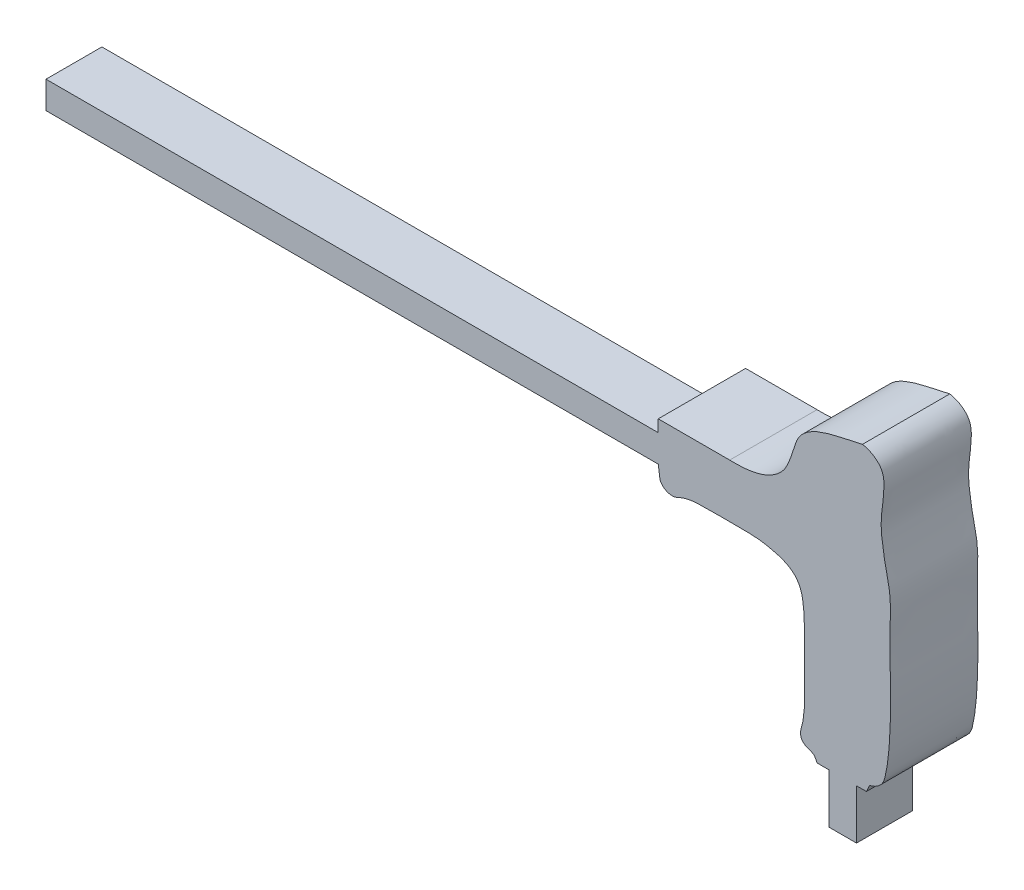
ISO-10303-21;
HEADER;
FILE_DESCRIPTION(('STEP AP214'),'2;1');
FILE_NAME('part.step','',(''),(''),'','','');
FILE_SCHEMA(('AUTOMOTIVE_DESIGN { 1 0 10303 214 1 1 1 1 }'));
ENDSEC;
DATA;
#1=APPLICATION_CONTEXT('core data for automotive mechanical design processes');
#2=APPLICATION_PROTOCOL_DEFINITION('international standard','automotive_design',2000,#1);
#3=PRODUCT_CONTEXT('',#1,'mechanical');
#4=PRODUCT('Part','Part','',(#3));
#5=PRODUCT_RELATED_PRODUCT_CATEGORY('part','',(#4));
#6=PRODUCT_DEFINITION_FORMATION('','',#4);
#7=PRODUCT_DEFINITION_CONTEXT('part definition',#1,'design');
#8=PRODUCT_DEFINITION('design','',#6,#7);
#9=PRODUCT_DEFINITION_SHAPE('','',#8);
#10=(LENGTH_UNIT() NAMED_UNIT(*) SI_UNIT(.MILLI.,.METRE.));
#11=(NAMED_UNIT(*) PLANE_ANGLE_UNIT() SI_UNIT($,.RADIAN.));
#12=(NAMED_UNIT(*) SI_UNIT($,.STERADIAN.) SOLID_ANGLE_UNIT());
#13=UNCERTAINTY_MEASURE_WITH_UNIT(LENGTH_MEASURE(1.E-05),#10,'distance_accuracy_value','');
#14=(GEOMETRIC_REPRESENTATION_CONTEXT(3) GLOBAL_UNCERTAINTY_ASSIGNED_CONTEXT((#13)) GLOBAL_UNIT_ASSIGNED_CONTEXT((#10,
#11,#12)) REPRESENTATION_CONTEXT('',''));
#15=CARTESIAN_POINT('',(0.,0.,0.));
#16=DIRECTION('',(0.,0.,1.));
#17=DIRECTION('',(1.,0.,0.));
#18=AXIS2_PLACEMENT_3D('',#15,#16,#17);
#19=CARTESIAN_POINT('',(244.511805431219,21.9032965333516,-12.5));
#20=DIRECTION('',(1.,0.,0.));
#21=DIRECTION('',(0.,0.,-1.));
#22=AXIS2_PLACEMENT_3D('',#19,#20,#21);
#23=PLANE('',#22);
#24=DIRECTION('',(0.,0.,1.));
#25=VECTOR('',#24,1.);
#26=CARTESIAN_POINT('',(244.511805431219,7.69104493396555,-12.5));
#27=LINE('',#26,#25);
#28=CARTESIAN_POINT('',(244.511805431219,7.69104493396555,-3.5));
#29=VERTEX_POINT('',#28);
#30=CARTESIAN_POINT('',(244.511805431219,7.69104493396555,12.5));
#31=VERTEX_POINT('',#30);
#32=EDGE_CURVE('E208',#29,#31,#27,.T.);
#33=ORIENTED_EDGE('',*,*,#32,.F.);
#34=DIRECTION('',(0.,-1.,0.));
#35=VECTOR('',#34,1.);
#36=CARTESIAN_POINT('',(244.511805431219,21.9032965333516,-3.5));
#37=LINE('',#36,#35);
#38=CARTESIAN_POINT('',(244.511805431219,21.9032965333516,-3.5));
#39=VERTEX_POINT('',#38);
#40=EDGE_CURVE('E411',#39,#29,#37,.T.);
#41=ORIENTED_EDGE('',*,*,#40,.F.);
#42=DIRECTION('',(0.,0.,1.));
#43=VECTOR('',#42,1.);
#44=CARTESIAN_POINT('',(244.511805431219,21.9032965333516,-12.5));
#45=LINE('',#44,#43);
#46=CARTESIAN_POINT('',(244.511805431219,21.9032965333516,12.5));
#47=VERTEX_POINT('',#46);
#48=EDGE_CURVE('E211',#39,#47,#45,.T.);
#49=ORIENTED_EDGE('',*,*,#48,.T.);
#50=DIRECTION('',(0.,1.,0.));
#51=VECTOR('',#50,1.);
#52=CARTESIAN_POINT('',(244.511805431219,21.9032965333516,12.5));
#53=LINE('',#52,#51);
#54=EDGE_CURVE('E384',#31,#47,#53,.T.);
#55=ORIENTED_EDGE('',*,*,#54,.F.);
#56=EDGE_LOOP('',(#33,#41,#49,#55));
#57=FACE_BOUND('',#56,.T.);
#58=ADVANCED_FACE('F39',(#57),#23,.T.);
#59=CARTESIAN_POINT('',(244.511805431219,7.69104493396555,-12.5));
#60=DIRECTION('',(0.,-1.,0.));
#61=DIRECTION('',(0.,0.,-1.));
#62=AXIS2_PLACEMENT_3D('',#59,#60,#61);
#63=PLANE('',#62);
#64=DIRECTION('',(0.,0.,1.));
#65=VECTOR('',#64,1.);
#66=CARTESIAN_POINT('',(236.593550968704,7.69104493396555,-12.5));
#67=LINE('',#66,#65);
#68=CARTESIAN_POINT('',(236.593550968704,7.69104493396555,-3.5));
#69=VERTEX_POINT('',#68);
#70=CARTESIAN_POINT('',(236.593550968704,7.69104493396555,12.5));
#71=VERTEX_POINT('',#70);
#72=EDGE_CURVE('E205',#69,#71,#67,.T.);
#73=ORIENTED_EDGE('',*,*,#72,.F.);
#74=DIRECTION('',(-1.,0.,0.));
#75=VECTOR('',#74,1.);
#76=CARTESIAN_POINT('',(244.511805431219,7.69104493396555,-3.5));
#77=LINE('',#76,#75);
#78=EDGE_CURVE('E409',#29,#69,#77,.T.);
#79=ORIENTED_EDGE('',*,*,#78,.F.);
#80=ORIENTED_EDGE('',*,*,#32,.T.);
#81=DIRECTION('',(1.,0.,0.));
#82=VECTOR('',#81,1.);
#83=CARTESIAN_POINT('',(244.511805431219,7.69104493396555,12.5));
#84=LINE('',#83,#82);
#85=EDGE_CURVE('E380',#71,#31,#84,.T.);
#86=ORIENTED_EDGE('',*,*,#85,.F.);
#87=EDGE_LOOP('',(#73,#79,#80,#86));
#88=FACE_BOUND('',#87,.T.);
#89=ADVANCED_FACE('F264',(#88),#63,.T.);
#90=CARTESIAN_POINT('',(236.593550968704,7.69104493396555,-12.5));
#91=DIRECTION('',(-1.,0.,0.));
#92=DIRECTION('',(0.,0.,1.));
#93=AXIS2_PLACEMENT_3D('',#90,#91,#92);
#94=PLANE('',#93);
#95=DIRECTION('',(0.,0.,1.));
#96=VECTOR('',#95,1.);
#97=CARTESIAN_POINT('',(236.593550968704,21.9032965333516,-12.5));
#98=LINE('',#97,#96);
#99=CARTESIAN_POINT('',(236.593550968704,21.9032965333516,-3.5));
#100=VERTEX_POINT('',#99);
#101=CARTESIAN_POINT('',(236.593550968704,21.9032965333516,12.5));
#102=VERTEX_POINT('',#101);
#103=EDGE_CURVE('E202',#100,#102,#98,.T.);
#104=ORIENTED_EDGE('',*,*,#103,.F.);
#105=DIRECTION('',(0.,1.,0.));
#106=VECTOR('',#105,1.);
#107=CARTESIAN_POINT('',(236.593550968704,21.9032965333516,-3.5));
#108=LINE('',#107,#106);
#109=EDGE_CURVE('E403',#69,#100,#108,.T.);
#110=ORIENTED_EDGE('',*,*,#109,.F.);
#111=ORIENTED_EDGE('',*,*,#72,.T.);
#112=DIRECTION('',(0.,-1.,0.));
#113=VECTOR('',#112,1.);
#114=CARTESIAN_POINT('',(236.593550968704,7.69104493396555,12.5));
#115=LINE('',#114,#113);
#116=EDGE_CURVE('E376',#102,#71,#115,.T.);
#117=ORIENTED_EDGE('',*,*,#116,.F.);
#118=EDGE_LOOP('',(#104,#110,#111,#117));
#119=FACE_BOUND('',#118,.T.);
#120=ADVANCED_FACE('F268',(#119),#94,.T.);
#121=CARTESIAN_POINT('',(187.756618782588,81.0544546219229,-12.5));
#122=DIRECTION('',(-1.,0.,0.));
#123=DIRECTION('',(0.,0.,1.));
#124=AXIS2_PLACEMENT_3D('',#121,#122,#123);
#125=PLANE('',#124);
#126=DIRECTION('',(0.,-1.,0.));
#127=VECTOR('',#126,1.);
#128=CARTESIAN_POINT('',(187.756618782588,81.0544546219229,-12.5));
#129=LINE('',#128,#127);
#130=CARTESIAN_POINT('',(187.756618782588,84.485599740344,-12.5));
#131=VERTEX_POINT('',#130);
#132=CARTESIAN_POINT('',(187.756618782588,73.2513278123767,-12.5));
#133=VERTEX_POINT('',#132);
#134=EDGE_CURVE('E329',#131,#133,#129,.T.);
#135=ORIENTED_EDGE('',*,*,#134,.T.);
#136=DIRECTION('',(0.,0.,1.));
#137=VECTOR('',#136,1.);
#138=CARTESIAN_POINT('',(187.756618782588,73.2513278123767,-12.5));
#139=LINE('',#138,#137);
#140=CARTESIAN_POINT('',(187.756618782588,73.2513278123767,-3.5));
#141=VERTEX_POINT('',#140);
#142=EDGE_CURVE('E190',#133,#141,#139,.T.);
#143=ORIENTED_EDGE('',*,*,#142,.T.);
#144=DIRECTION('',(0.,-1.,0.));
#145=VECTOR('',#144,1.);
#146=CARTESIAN_POINT('',(187.756618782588,81.0544546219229,-3.5));
#147=LINE('',#146,#145);
#148=CARTESIAN_POINT('',(187.756618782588,81.0544546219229,-3.5));
#149=VERTEX_POINT('',#148);
#150=EDGE_CURVE('E176',#149,#141,#147,.T.);
#151=ORIENTED_EDGE('',*,*,#150,.F.);
#152=DIRECTION('',(0.,0.,1.));
#153=VECTOR('',#152,1.);
#154=CARTESIAN_POINT('',(187.756618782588,81.0544546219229,-12.5));
#155=LINE('',#154,#153);
#156=CARTESIAN_POINT('',(187.756618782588,81.0544546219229,12.5));
#157=VERTEX_POINT('',#156);
#158=EDGE_CURVE('E43',#149,#157,#155,.T.);
#159=ORIENTED_EDGE('',*,*,#158,.T.);
#160=DIRECTION('',(0.,-1.,0.));
#161=VECTOR('',#160,1.);
#162=CARTESIAN_POINT('',(187.756618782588,81.0544546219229,12.5));
#163=LINE('',#162,#161);
#164=CARTESIAN_POINT('',(187.756618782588,84.485599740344,12.5));
#165=VERTEX_POINT('',#164);
#166=EDGE_CURVE('E424',#165,#157,#163,.T.);
#167=ORIENTED_EDGE('',*,*,#166,.F.);
#168=DIRECTION('',(0.,0.,1.));
#169=VECTOR('',#168,1.);
#170=CARTESIAN_POINT('',(187.756618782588,84.485599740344,-12.5));
#171=LINE('',#170,#169);
#172=EDGE_CURVE('E11',#131,#165,#171,.T.);
#173=ORIENTED_EDGE('',*,*,#172,.F.);
#174=EDGE_LOOP('',(#135,#143,#151,#159,#167,#173));
#175=FACE_BOUND('',#174,.T.);
#176=ADVANCED_FACE('F41',(#175),#125,.T.);
#177=CARTESIAN_POINT('',(187.756618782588,84.485599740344,-12.5));
#178=DIRECTION('',(0.,1.,0.));
#179=DIRECTION('',(0.,0.,1.));
#180=AXIS2_PLACEMENT_3D('',#177,#178,#179);
#181=PLANE('',#180);
#182=ORIENTED_EDGE('',*,*,#172,.T.);
#183=DIRECTION('',(-1.,0.,0.));
#184=VECTOR('',#183,1.);
#185=CARTESIAN_POINT('',(187.756618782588,84.485599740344,12.5));
#186=LINE('',#185,#184);
#187=CARTESIAN_POINT('',(208.214218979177,84.485599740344,12.5));
#188=VERTEX_POINT('',#187);
#189=EDGE_CURVE('E324',#188,#165,#186,.T.);
#190=ORIENTED_EDGE('',*,*,#189,.F.);
#191=DIRECTION('',(0.,0.,1.));
#192=VECTOR('',#191,1.);
#193=CARTESIAN_POINT('',(208.214218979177,84.485599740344,-12.5));
#194=LINE('',#193,#192);
#195=CARTESIAN_POINT('',(208.214218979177,84.485599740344,-12.5));
#196=VERTEX_POINT('',#195);
#197=EDGE_CURVE('E49',#196,#188,#194,.T.);
#198=ORIENTED_EDGE('',*,*,#197,.F.);
#199=DIRECTION('',(-1.,0.,0.));
#200=VECTOR('',#199,1.);
#201=CARTESIAN_POINT('',(187.756618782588,84.485599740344,-12.5));
#202=LINE('',#201,#200);
#203=EDGE_CURVE('E188',#196,#131,#202,.T.);
#204=ORIENTED_EDGE('',*,*,#203,.T.);
#205=EDGE_LOOP('',(#182,#190,#198,#204));
#206=FACE_BOUND('',#205,.T.);
#207=ADVANCED_FACE('F247',(#206),#181,.T.);
#208=CARTESIAN_POINT('',(246.214700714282,107.391044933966,-12.5));
#209=CARTESIAN_POINT('',(242.375727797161,106.412295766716,-12.5));
#210=CARTESIAN_POINT('',(236.917253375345,105.685804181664,-12.5));
#211=CARTESIAN_POINT('',(230.665661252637,102.945720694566,-12.5));
#212=CARTESIAN_POINT('',(227.725149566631,100.180588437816,-12.5));
#213=CARTESIAN_POINT('',(226.478322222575,96.2014959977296,-12.5));
#214=CARTESIAN_POINT('',(225.437634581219,92.9080890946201,-12.5));
#215=CARTESIAN_POINT('',(223.407073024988,88.9183458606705,-12.5));
#216=CARTESIAN_POINT('',(217.913923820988,84.7718855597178,-12.5));
#217=CARTESIAN_POINT('',(211.91060473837,84.3985547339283,-12.5));
#218=CARTESIAN_POINT('',(208.214218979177,84.485599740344,-12.5));
#219=B_SPLINE_CURVE_WITH_KNOTS('',3,(#208,#209,#210,#211,#212,#213,#214,#215,#216,#217,#218),
.UNSPECIFIED.,.F.,.F.,(4,1,1,1,1,1,1,1,4),(0.,0.248399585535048,0.338544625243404,
0.423367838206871,0.489303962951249,0.59489432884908,0.639647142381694,0.766674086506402,1.),.UNSPECIFIED.);
#220=DIRECTION('',(0.,0.,1.));
#221=VECTOR('',#220,1.);
#222=SURFACE_OF_LINEAR_EXTRUSION('',#219,#221);
#223=ORIENTED_EDGE('',*,*,#197,.T.);
#224=CARTESIAN_POINT('',(246.214700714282,107.391044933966,12.5));
#225=CARTESIAN_POINT('',(242.375727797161,106.412295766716,12.5));
#226=CARTESIAN_POINT('',(236.917253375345,105.685804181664,12.5));
#227=CARTESIAN_POINT('',(230.665661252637,102.945720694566,12.5));
#228=CARTESIAN_POINT('',(227.725149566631,100.180588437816,12.5));
#229=CARTESIAN_POINT('',(226.478322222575,96.2014959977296,12.5));
#230=CARTESIAN_POINT('',(225.437634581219,92.9080890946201,12.5));
#231=CARTESIAN_POINT('',(223.407073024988,88.9183458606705,12.5));
#232=CARTESIAN_POINT('',(217.913923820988,84.7718855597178,12.5));
#233=CARTESIAN_POINT('',(211.91060473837,84.3985547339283,12.5));
#234=CARTESIAN_POINT('',(208.214218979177,84.485599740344,12.5));
#235=B_SPLINE_CURVE_WITH_KNOTS('',3,(#224,#225,#226,#227,#228,#229,#230,#231,#232,#233,#234),
.UNSPECIFIED.,.F.,.F.,(4,1,1,1,1,1,1,1,4),(0.,0.248399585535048,0.338544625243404,
0.423367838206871,0.489303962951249,0.59489432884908,0.639647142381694,0.766674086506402,1.),.UNSPECIFIED.);
#236=CARTESIAN_POINT('',(246.214700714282,107.391044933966,12.5));
#237=VERTEX_POINT('',#236);
#238=EDGE_CURVE('E320',#237,#188,#235,.T.);
#239=ORIENTED_EDGE('',*,*,#238,.F.);
#240=DIRECTION('',(0.,0.,1.));
#241=VECTOR('',#240,1.);
#242=CARTESIAN_POINT('',(246.214700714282,107.391044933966,-12.5));
#243=LINE('',#242,#241);
#244=CARTESIAN_POINT('',(246.214700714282,107.391044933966,-12.5));
#245=VERTEX_POINT('',#244);
#246=EDGE_CURVE('E220',#245,#237,#243,.T.);
#247=ORIENTED_EDGE('',*,*,#246,.F.);
#248=EDGE_CURVE('E227',#245,#196,#219,.T.);
#249=ORIENTED_EDGE('',*,*,#248,.T.);
#250=EDGE_LOOP('',(#223,#239,#247,#249));
#251=FACE_BOUND('',#250,.T.);
#252=ADVANCED_FACE('F242',(#251),#222,.T.);
#253=CARTESIAN_POINT('',(248.209058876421,23.8286695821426,-12.5));
#254=CARTESIAN_POINT('',(249.528364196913,24.154001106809,-12.5));
#255=CARTESIAN_POINT('',(252.05230233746,25.4730285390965,-12.5));
#256=CARTESIAN_POINT('',(253.144765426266,29.8733528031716,-12.5));
#257=CARTESIAN_POINT('',(253.974148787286,36.2068183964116,-12.5));
#258=CARTESIAN_POINT('',(254.277552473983,44.1943170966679,-12.5));
#259=CARTESIAN_POINT('',(254.311303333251,52.8678082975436,-12.5));
#260=CARTESIAN_POINT('',(253.992303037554,60.1544737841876,-12.5));
#261=CARTESIAN_POINT('',(254.176916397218,66.9344270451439,-12.5));
#262=CARTESIAN_POINT('',(254.31064183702,72.2706746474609,-12.5));
#263=CARTESIAN_POINT('',(253.730005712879,76.7510030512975,-12.5));
#264=CARTESIAN_POINT('',(252.854498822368,79.8664951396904,-12.5));
#265=CARTESIAN_POINT('',(252.088666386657,84.7422977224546,-12.5));
#266=CARTESIAN_POINT('',(251.233244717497,89.6362549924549,-12.5));
#267=CARTESIAN_POINT('',(251.934884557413,94.7443980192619,-12.5));
#268=CARTESIAN_POINT('',(252.304516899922,98.1834969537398,-12.5));
#269=CARTESIAN_POINT('',(252.488193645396,101.030567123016,-12.5));
#270=CARTESIAN_POINT('',(251.625425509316,105.185535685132,-12.5));
#271=CARTESIAN_POINT('',(248.410956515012,107.015595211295,-12.5));
#272=CARTESIAN_POINT('',(246.214700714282,107.391044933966,-12.5));
#273=B_SPLINE_CURVE_WITH_KNOTS('',3,(#253,#254,#255,#256,#257,#258,#259,#260,#261,#262,#263,
#264,#265,#266,#267,#268,#269,#270,#271,#272),.UNSPECIFIED.,.F.,.F.,(4,1,1,1,1,1,1,1,1,1,1,1,1,
1,1,1,1,4),(0.,0.0472693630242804,0.0847386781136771,0.145646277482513,0.264578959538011,
0.35151418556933,0.437420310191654,0.509371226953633,0.579468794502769,0.616352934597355,
0.660692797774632,0.687900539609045,0.7823156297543,0.825241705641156,0.860363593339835,
0.898716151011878,0.920706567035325,1.),.UNSPECIFIED.);
#274=DIRECTION('',(0.,0.,1.));
#275=VECTOR('',#274,1.);
#276=SURFACE_OF_LINEAR_EXTRUSION('',#273,#275);
#277=ORIENTED_EDGE('',*,*,#246,.T.);
#278=CARTESIAN_POINT('',(248.209058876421,23.8286695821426,12.5));
#279=CARTESIAN_POINT('',(249.528364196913,24.154001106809,12.5));
#280=CARTESIAN_POINT('',(252.05230233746,25.4730285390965,12.5));
#281=CARTESIAN_POINT('',(253.144765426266,29.8733528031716,12.5));
#282=CARTESIAN_POINT('',(253.974148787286,36.2068183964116,12.5));
#283=CARTESIAN_POINT('',(254.277552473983,44.1943170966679,12.5));
#284=CARTESIAN_POINT('',(254.311303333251,52.8678082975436,12.5));
#285=CARTESIAN_POINT('',(253.992303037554,60.1544737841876,12.5));
#286=CARTESIAN_POINT('',(254.176916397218,66.9344270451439,12.5));
#287=CARTESIAN_POINT('',(254.31064183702,72.2706746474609,12.5));
#288=CARTESIAN_POINT('',(253.730005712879,76.7510030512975,12.5));
#289=CARTESIAN_POINT('',(252.854498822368,79.8664951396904,12.5));
#290=CARTESIAN_POINT('',(252.088666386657,84.7422977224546,12.5));
#291=CARTESIAN_POINT('',(251.233244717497,89.6362549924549,12.5));
#292=CARTESIAN_POINT('',(251.934884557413,94.7443980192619,12.5));
#293=CARTESIAN_POINT('',(252.304516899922,98.1834969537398,12.5));
#294=CARTESIAN_POINT('',(252.488193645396,101.030567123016,12.5));
#295=CARTESIAN_POINT('',(251.625425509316,105.185535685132,12.5));
#296=CARTESIAN_POINT('',(248.410956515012,107.015595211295,12.5));
#297=CARTESIAN_POINT('',(246.214700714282,107.391044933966,12.5));
#298=B_SPLINE_CURVE_WITH_KNOTS('',3,(#278,#279,#280,#281,#282,#283,#284,#285,#286,#287,#288,
#289,#290,#291,#292,#293,#294,#295,#296,#297),.UNSPECIFIED.,.F.,.F.,(4,1,1,1,1,1,1,1,1,1,1,1,1,
1,1,1,1,4),(0.,0.0472693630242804,0.0847386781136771,0.145646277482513,0.264578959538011,
0.35151418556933,0.437420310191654,0.509371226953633,0.579468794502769,0.616352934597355,
0.660692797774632,0.687900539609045,0.7823156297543,0.825241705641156,0.860363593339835,
0.898716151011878,0.920706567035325,1.),.UNSPECIFIED.);
#299=CARTESIAN_POINT('',(248.209058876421,23.8286695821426,12.5));
#300=VERTEX_POINT('',#299);
#301=EDGE_CURVE('E325',#300,#237,#298,.T.);
#302=ORIENTED_EDGE('',*,*,#301,.F.);
#303=DIRECTION('',(0.,0.,1.));
#304=VECTOR('',#303,1.);
#305=CARTESIAN_POINT('',(248.209058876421,23.8286695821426,-12.5));
#306=LINE('',#305,#304);
#307=CARTESIAN_POINT('',(248.209058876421,23.8286695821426,-12.5));
#308=VERTEX_POINT('',#307);
#309=EDGE_CURVE('E217',#308,#300,#306,.T.);
#310=ORIENTED_EDGE('',*,*,#309,.F.);
#311=EDGE_CURVE('E233',#308,#245,#273,.T.);
#312=ORIENTED_EDGE('',*,*,#311,.T.);
#313=EDGE_LOOP('',(#277,#302,#310,#312));
#314=FACE_BOUND('',#313,.T.);
#315=ADVANCED_FACE('F246',(#314),#276,.T.);
#316=CARTESIAN_POINT('',(248.209058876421,23.8286695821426,-12.5));
#317=DIRECTION('',(0.91397324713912,-0.405774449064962,0.));
#318=DIRECTION('',(0.405774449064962,0.91397324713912,0.));
#319=AXIS2_PLACEMENT_3D('',#316,#317,#318);
#320=PLANE('',#319);
#321=ORIENTED_EDGE('',*,*,#309,.T.);
#322=DIRECTION('',(0.405774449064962,0.91397324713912,0.));
#323=VECTOR('',#322,1.);
#324=CARTESIAN_POINT('',(248.209058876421,23.8286695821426,12.5));
#325=LINE('',#324,#323);
#326=CARTESIAN_POINT('',(247.354255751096,21.9032965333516,12.5));
#327=VERTEX_POINT('',#326);
#328=EDGE_CURVE('E331',#327,#300,#325,.T.);
#329=ORIENTED_EDGE('',*,*,#328,.F.);
#330=DIRECTION('',(0.,0.,1.));
#331=VECTOR('',#330,1.);
#332=CARTESIAN_POINT('',(247.354255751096,21.9032965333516,-12.5));
#333=LINE('',#332,#331);
#334=CARTESIAN_POINT('',(247.354255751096,21.9032965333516,-12.5));
#335=VERTEX_POINT('',#334);
#336=EDGE_CURVE('E214',#335,#327,#333,.T.);
#337=ORIENTED_EDGE('',*,*,#336,.F.);
#338=DIRECTION('',(0.405774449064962,0.91397324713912,0.));
#339=VECTOR('',#338,1.);
#340=CARTESIAN_POINT('',(248.209058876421,23.8286695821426,-12.5));
#341=LINE('',#340,#339);
#342=EDGE_CURVE('E302',#335,#308,#341,.T.);
#343=ORIENTED_EDGE('',*,*,#342,.T.);
#344=EDGE_LOOP('',(#321,#329,#337,#343));
#345=FACE_BOUND('',#344,.T.);
#346=ADVANCED_FACE('F252',(#345),#320,.T.);
#347=CARTESIAN_POINT('',(247.354255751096,21.9032965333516,-12.5));
#348=DIRECTION('',(0.,-1.,0.));
#349=DIRECTION('',(0.,0.,-1.));
#350=AXIS2_PLACEMENT_3D('',#347,#348,#349);
#351=PLANE('',#350);
#352=ORIENTED_EDGE('',*,*,#336,.T.);
#353=DIRECTION('',(1.,0.,0.));
#354=VECTOR('',#353,1.);
#355=CARTESIAN_POINT('',(247.354255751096,21.9032965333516,12.5));
#356=LINE('',#355,#354);
#357=EDGE_CURVE('E388',#47,#327,#356,.T.);
#358=ORIENTED_EDGE('',*,*,#357,.F.);
#359=ORIENTED_EDGE('',*,*,#48,.F.);
#360=DIRECTION('',(1.,0.,0.));
#361=VECTOR('',#360,1.);
#362=CARTESIAN_POINT('',(244.511805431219,21.9032965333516,-3.5));
#363=LINE('',#362,#361);
#364=EDGE_CURVE('E168',#100,#39,#363,.T.);
#365=ORIENTED_EDGE('',*,*,#364,.F.);
#366=ORIENTED_EDGE('',*,*,#103,.T.);
#367=DIRECTION('',(1.,0.,0.));
#368=VECTOR('',#367,1.);
#369=CARTESIAN_POINT('',(236.593550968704,21.9032965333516,12.5));
#370=LINE('',#369,#368);
#371=CARTESIAN_POINT('',(233.277358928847,21.9032965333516,12.5));
#372=VERTEX_POINT('',#371);
#373=EDGE_CURVE('E362',#372,#102,#370,.T.);
#374=ORIENTED_EDGE('',*,*,#373,.F.);
#375=DIRECTION('',(0.,0.,1.));
#376=VECTOR('',#375,1.);
#377=CARTESIAN_POINT('',(233.277358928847,21.9032965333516,-12.5));
#378=LINE('',#377,#376);
#379=CARTESIAN_POINT('',(233.277358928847,21.9032965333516,-12.5));
#380=VERTEX_POINT('',#379);
#381=EDGE_CURVE('E199',#380,#372,#378,.T.);
#382=ORIENTED_EDGE('',*,*,#381,.F.);
#383=DIRECTION('',(1.,0.,0.));
#384=VECTOR('',#383,1.);
#385=CARTESIAN_POINT('',(236.593550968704,21.9032965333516,-12.5));
#386=LINE('',#385,#384);
#387=EDGE_CURVE('E300',#380,#335,#386,.T.);
#388=ORIENTED_EDGE('',*,*,#387,.T.);
#389=EDGE_LOOP('',(#352,#358,#359,#365,#366,#374,#382,#388));
#390=FACE_BOUND('',#389,.T.);
#391=ADVANCED_FACE('F256',(#390),#351,.T.);
#392=CARTESIAN_POINT('',(233.277358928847,21.9032965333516,-12.5));
#393=DIRECTION('',(-0.863614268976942,-0.504153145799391,0.));
#394=DIRECTION('',(0.504153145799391,-0.863614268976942,0.));
#395=AXIS2_PLACEMENT_3D('',#392,#393,#394);
#396=PLANE('',#395);
#397=ORIENTED_EDGE('',*,*,#381,.T.);
#398=DIRECTION('',(0.504153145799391,-0.863614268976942,0.));
#399=VECTOR('',#398,1.);
#400=CARTESIAN_POINT('',(233.277358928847,21.9032965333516,12.5));
#401=LINE('',#400,#399);
#402=CARTESIAN_POINT('',(232.334001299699,23.5192680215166,12.5));
#403=VERTEX_POINT('',#402);
#404=EDGE_CURVE('E357',#403,#372,#401,.T.);
#405=ORIENTED_EDGE('',*,*,#404,.F.);
#406=DIRECTION('',(0.,0.,1.));
#407=VECTOR('',#406,1.);
#408=CARTESIAN_POINT('',(232.334001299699,23.5192680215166,-12.5));
#409=LINE('',#408,#407);
#410=CARTESIAN_POINT('',(232.334001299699,23.5192680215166,-12.5));
#411=VERTEX_POINT('',#410);
#412=EDGE_CURVE('E196',#411,#403,#409,.T.);
#413=ORIENTED_EDGE('',*,*,#412,.F.);
#414=DIRECTION('',(0.504153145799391,-0.863614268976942,0.));
#415=VECTOR('',#414,1.);
#416=CARTESIAN_POINT('',(233.277358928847,21.9032965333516,-12.5));
#417=LINE('',#416,#415);
#418=EDGE_CURVE('E291',#411,#380,#417,.T.);
#419=ORIENTED_EDGE('',*,*,#418,.T.);
#420=EDGE_LOOP('',(#397,#405,#413,#419));
#421=FACE_BOUND('',#420,.T.);
#422=ADVANCED_FACE('F260',(#421),#396,.T.);
#423=CARTESIAN_POINT('',(188.176046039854,70.2576744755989,-12.5));
#424=CARTESIAN_POINT('',(188.24611913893,69.0753053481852,-12.5));
#425=CARTESIAN_POINT('',(189.787575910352,67.4763934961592,-12.5));
#426=CARTESIAN_POINT('',(192.409481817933,67.2679133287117,-12.5));
#427=CARTESIAN_POINT('',(194.782549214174,68.505781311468,-12.5));
#428=CARTESIAN_POINT('',(197.556051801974,69.122937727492,-12.5));
#429=CARTESIAN_POINT('',(201.594079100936,69.1584529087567,-12.5));
#430=CARTESIAN_POINT('',(206.505428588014,69.2397653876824,-12.5));
#431=CARTESIAN_POINT('',(211.662558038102,69.2249809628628,-12.5));
#432=CARTESIAN_POINT('',(216.831235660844,69.080052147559,-12.5));
#433=CARTESIAN_POINT('',(221.632048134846,68.1657864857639,-12.5));
#434=CARTESIAN_POINT('',(226.200355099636,66.4395988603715,-12.5));
#435=CARTESIAN_POINT('',(228.744451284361,62.7400590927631,-12.5));
#436=CARTESIAN_POINT('',(229.443582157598,58.50976109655,-12.5));
#437=CARTESIAN_POINT('',(229.681834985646,52.5370276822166,-12.5));
#438=CARTESIAN_POINT('',(229.513097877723,45.6049428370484,-12.5));
#439=CARTESIAN_POINT('',(229.577241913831,39.1970828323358,-12.5));
#440=CARTESIAN_POINT('',(229.693632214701,34.5544111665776,-12.5));
#441=CARTESIAN_POINT('',(229.417889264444,31.6520560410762,-12.5));
#442=CARTESIAN_POINT('',(229.014349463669,29.2446997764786,-12.5));
#443=CARTESIAN_POINT('',(228.269217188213,27.3328878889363,-12.5));
#444=CARTESIAN_POINT('',(228.985060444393,24.4321143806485,-12.5));
#445=CARTESIAN_POINT('',(231.338572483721,24.060331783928,-12.5));
#446=CARTESIAN_POINT('',(232.334001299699,23.5192680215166,-12.5));
#447=B_SPLINE_CURVE_WITH_KNOTS('',3,(#423,#424,#425,#426,#427,#428,#429,#430,#431,#432,#433,
#434,#435,#436,#437,#438,#439,#440,#441,#442,#443,#444,#445,#446),.UNSPECIFIED.,.F.,.F.,(4,1,1,
1,1,1,1,1,1,1,1,1,1,1,1,1,1,1,1,1,1,4),(0.,0.0390468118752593,0.0701022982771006,
0.0843821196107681,0.13229581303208,0.167829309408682,0.226062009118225,0.304529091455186,
0.348961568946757,0.406759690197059,0.477041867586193,0.511358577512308,0.559057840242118,
0.624883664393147,0.721626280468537,0.801896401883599,0.849792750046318,0.884349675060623,
0.903946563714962,0.935404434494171,0.954916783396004,1.),.UNSPECIFIED.);
#448=DIRECTION('',(0.,0.,1.));
#449=VECTOR('',#448,1.);
#450=SURFACE_OF_LINEAR_EXTRUSION('',#447,#449);
#451=ORIENTED_EDGE('',*,*,#412,.T.);
#452=CARTESIAN_POINT('',(188.176046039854,70.2576744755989,12.5));
#453=CARTESIAN_POINT('',(188.24611913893,69.0753053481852,12.5));
#454=CARTESIAN_POINT('',(189.787575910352,67.4763934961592,12.5));
#455=CARTESIAN_POINT('',(192.409481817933,67.2679133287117,12.5));
#456=CARTESIAN_POINT('',(194.782549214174,68.505781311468,12.5));
#457=CARTESIAN_POINT('',(197.556051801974,69.122937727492,12.5));
#458=CARTESIAN_POINT('',(201.594079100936,69.1584529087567,12.5));
#459=CARTESIAN_POINT('',(206.505428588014,69.2397653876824,12.5));
#460=CARTESIAN_POINT('',(211.662558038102,69.2249809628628,12.5));
#461=CARTESIAN_POINT('',(216.831235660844,69.080052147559,12.5));
#462=CARTESIAN_POINT('',(221.632048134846,68.1657864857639,12.5));
#463=CARTESIAN_POINT('',(226.200355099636,66.4395988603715,12.5));
#464=CARTESIAN_POINT('',(228.744451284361,62.7400590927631,12.5));
#465=CARTESIAN_POINT('',(229.443582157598,58.50976109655,12.5));
#466=CARTESIAN_POINT('',(229.681834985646,52.5370276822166,12.5));
#467=CARTESIAN_POINT('',(229.513097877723,45.6049428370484,12.5));
#468=CARTESIAN_POINT('',(229.577241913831,39.1970828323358,12.5));
#469=CARTESIAN_POINT('',(229.693632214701,34.5544111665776,12.5));
#470=CARTESIAN_POINT('',(229.417889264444,31.6520560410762,12.5));
#471=CARTESIAN_POINT('',(229.014349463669,29.2446997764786,12.5));
#472=CARTESIAN_POINT('',(228.269217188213,27.3328878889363,12.5));
#473=CARTESIAN_POINT('',(228.985060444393,24.4321143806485,12.5));
#474=CARTESIAN_POINT('',(231.338572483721,24.060331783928,12.5));
#475=CARTESIAN_POINT('',(232.334001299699,23.5192680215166,12.5));
#476=B_SPLINE_CURVE_WITH_KNOTS('',3,(#452,#453,#454,#455,#456,#457,#458,#459,#460,#461,#462,
#463,#464,#465,#466,#467,#468,#469,#470,#471,#472,#473,#474,#475),.UNSPECIFIED.,.F.,.F.,(4,1,1,
1,1,1,1,1,1,1,1,1,1,1,1,1,1,1,1,1,1,4),(0.,0.0390468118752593,0.0701022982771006,
0.0843821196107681,0.13229581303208,0.167829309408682,0.226062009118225,0.304529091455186,
0.348961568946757,0.406759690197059,0.477041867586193,0.511358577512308,0.559057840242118,
0.624883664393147,0.721626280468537,0.801896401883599,0.849792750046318,0.884349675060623,
0.903946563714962,0.935404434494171,0.954916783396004,1.),.UNSPECIFIED.);
#477=CARTESIAN_POINT('',(188.176046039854,70.2576744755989,12.5));
#478=VERTEX_POINT('',#477);
#479=EDGE_CURVE('E353',#478,#403,#476,.T.);
#480=ORIENTED_EDGE('',*,*,#479,.F.);
#481=DIRECTION('',(0.,0.,1.));
#482=VECTOR('',#481,1.);
#483=CARTESIAN_POINT('',(188.176046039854,70.2576744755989,-12.5));
#484=LINE('',#483,#482);
#485=CARTESIAN_POINT('',(188.176046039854,70.2576744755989,-12.5));
#486=VERTEX_POINT('',#485);
#487=EDGE_CURVE('E193',#486,#478,#484,.T.);
#488=ORIENTED_EDGE('',*,*,#487,.F.);
#489=EDGE_CURVE('E283',#486,#411,#447,.T.);
#490=ORIENTED_EDGE('',*,*,#489,.T.);
#491=EDGE_LOOP('',(#451,#480,#488,#490));
#492=FACE_BOUND('',#491,.T.);
#493=ADVANCED_FACE('F275',(#492),#450,.T.);
#494=CARTESIAN_POINT('',(187.756618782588,73.2513278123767,-12.5));
#495=DIRECTION('',(-0.990327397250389,-0.138750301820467,0.));
#496=DIRECTION('',(0.138750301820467,-0.990327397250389,0.));
#497=AXIS2_PLACEMENT_3D('',#494,#495,#496);
#498=PLANE('',#497);
#499=ORIENTED_EDGE('',*,*,#487,.T.);
#500=DIRECTION('',(0.138750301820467,-0.990327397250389,0.));
#501=VECTOR('',#500,1.);
#502=CARTESIAN_POINT('',(187.756618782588,73.2513278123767,12.5));
#503=LINE('',#502,#501);
#504=CARTESIAN_POINT('',(187.756618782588,73.2513278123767,12.5));
#505=VERTEX_POINT('',#504);
#506=EDGE_CURVE('E358',#505,#478,#503,.T.);
#507=ORIENTED_EDGE('',*,*,#506,.F.);
#508=EDGE_CURVE('E186',#141,#505,#139,.T.);
#509=ORIENTED_EDGE('',*,*,#508,.F.);
#510=ORIENTED_EDGE('',*,*,#142,.F.);
#511=DIRECTION('',(0.138750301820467,-0.990327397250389,0.));
#512=VECTOR('',#511,1.);
#513=CARTESIAN_POINT('',(187.756618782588,73.2513278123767,-12.5));
#514=LINE('',#513,#512);
#515=EDGE_CURVE('E292',#133,#486,#514,.T.);
#516=ORIENTED_EDGE('',*,*,#515,.T.);
#517=EDGE_LOOP('',(#499,#507,#509,#510,#516));
#518=FACE_BOUND('',#517,.T.);
#519=ADVANCED_FACE('F280',(#518),#498,.T.);
#520=CARTESIAN_POINT('',(12.5132434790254,73.2513278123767,-12.5));
#521=DIRECTION('',(0.,-1.,0.));
#522=DIRECTION('',(0.,0.,-1.));
#523=AXIS2_PLACEMENT_3D('',#520,#521,#522);
#524=PLANE('',#523);
#525=DIRECTION('',(-1.,0.,0.));
#526=VECTOR('',#525,1.);
#527=CARTESIAN_POINT('',(12.5132434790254,73.2513278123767,-3.5));
#528=LINE('',#527,#526);
#529=CARTESIAN_POINT('',(12.5132434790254,73.2513278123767,-3.5));
#530=VERTEX_POINT('',#529);
#531=EDGE_CURVE('E163',#141,#530,#528,.T.);
#532=ORIENTED_EDGE('',*,*,#531,.F.);
#533=ORIENTED_EDGE('',*,*,#508,.T.);
#534=DIRECTION('',(1.,0.,0.));
#535=VECTOR('',#534,1.);
#536=CARTESIAN_POINT('',(12.5132434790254,73.2513278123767,12.5));
#537=LINE('',#536,#535);
#538=CARTESIAN_POINT('',(12.5132434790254,73.2513278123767,12.5));
#539=VERTEX_POINT('',#538);
#540=EDGE_CURVE('E364',#539,#505,#537,.T.);
#541=ORIENTED_EDGE('',*,*,#540,.F.);
#542=DIRECTION('',(0.,0.,1.));
#543=VECTOR('',#542,1.);
#544=CARTESIAN_POINT('',(12.5132434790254,73.2513278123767,-12.5));
#545=LINE('',#544,#543);
#546=EDGE_CURVE('E183',#530,#539,#545,.T.);
#547=ORIENTED_EDGE('',*,*,#546,.F.);
#548=EDGE_LOOP('',(#532,#533,#541,#547));
#549=FACE_BOUND('',#548,.T.);
#550=ADVANCED_FACE('F436',(#549),#524,.T.);
#551=CARTESIAN_POINT('',(12.5132434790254,81.0544546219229,-12.5));
#552=DIRECTION('',(-1.,0.,0.));
#553=DIRECTION('',(0.,0.,1.));
#554=AXIS2_PLACEMENT_3D('',#551,#552,#553);
#555=PLANE('',#554);
#556=DIRECTION('',(0.,1.,0.));
#557=VECTOR('',#556,1.);
#558=CARTESIAN_POINT('',(12.5132434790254,81.0544546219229,-3.5));
#559=LINE('',#558,#557);
#560=CARTESIAN_POINT('',(12.5132434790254,81.0544546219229,-3.5));
#561=VERTEX_POINT('',#560);
#562=EDGE_CURVE('E156',#530,#561,#559,.T.);
#563=ORIENTED_EDGE('',*,*,#562,.F.);
#564=ORIENTED_EDGE('',*,*,#546,.T.);
#565=DIRECTION('',(0.,-1.,0.));
#566=VECTOR('',#565,1.);
#567=CARTESIAN_POINT('',(12.5132434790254,81.0544546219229,12.5));
#568=LINE('',#567,#566);
#569=CARTESIAN_POINT('',(12.5132434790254,81.0544546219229,12.5));
#570=VERTEX_POINT('',#569);
#571=EDGE_CURVE('E181',#570,#539,#568,.T.);
#572=ORIENTED_EDGE('',*,*,#571,.F.);
#573=DIRECTION('',(0.,0.,1.));
#574=VECTOR('',#573,1.);
#575=CARTESIAN_POINT('',(12.5132434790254,81.0544546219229,-12.5));
#576=LINE('',#575,#574);
#577=EDGE_CURVE('E173',#561,#570,#576,.T.);
#578=ORIENTED_EDGE('',*,*,#577,.F.);
#579=EDGE_LOOP('',(#563,#564,#572,#578));
#580=FACE_BOUND('',#579,.T.);
#581=ADVANCED_FACE('F179',(#580),#555,.T.);
#582=CARTESIAN_POINT('',(187.756618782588,81.0544546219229,-12.5));
#583=DIRECTION('',(0.,1.,0.));
#584=DIRECTION('',(0.,0.,1.));
#585=AXIS2_PLACEMENT_3D('',#582,#583,#584);
#586=PLANE('',#585);
#587=DIRECTION('',(1.,0.,0.));
#588=VECTOR('',#587,1.);
#589=CARTESIAN_POINT('',(12.5132434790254,81.0544546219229,-3.5));
#590=LINE('',#589,#588);
#591=EDGE_CURVE('E160',#561,#149,#590,.T.);
#592=ORIENTED_EDGE('',*,*,#591,.F.);
#593=ORIENTED_EDGE('',*,*,#577,.T.);
#594=DIRECTION('',(-1.,0.,0.));
#595=VECTOR('',#594,1.);
#596=CARTESIAN_POINT('',(187.756618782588,81.0544546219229,12.5));
#597=LINE('',#596,#595);
#598=EDGE_CURVE('E427',#157,#570,#597,.T.);
#599=ORIENTED_EDGE('',*,*,#598,.F.);
#600=ORIENTED_EDGE('',*,*,#158,.F.);
#601=EDGE_LOOP('',(#592,#593,#599,#600));
#602=FACE_BOUND('',#601,.T.);
#603=ADVANCED_FACE('F171',(#602),#586,.T.);
#604=CARTESIAN_POINT('',(226.516988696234,96.3306724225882,-12.5));
#605=DIRECTION('',(0.,0.,-1.));
#606=DIRECTION('',(-1.,0.,0.));
#607=AXIS2_PLACEMENT_3D('',#604,#605,#606);
#608=PLANE('',#607);
#609=ORIENTED_EDGE('',*,*,#515,.F.);
#610=ORIENTED_EDGE('',*,*,#134,.F.);
#611=ORIENTED_EDGE('',*,*,#203,.F.);
#612=ORIENTED_EDGE('',*,*,#248,.F.);
#613=ORIENTED_EDGE('',*,*,#311,.F.);
#614=ORIENTED_EDGE('',*,*,#342,.F.);
#615=ORIENTED_EDGE('',*,*,#387,.F.);
#616=ORIENTED_EDGE('',*,*,#418,.F.);
#617=ORIENTED_EDGE('',*,*,#489,.F.);
#618=EDGE_LOOP('',(#609,#610,#611,#612,#613,#614,#615,#616,#617));
#619=FACE_BOUND('',#618,.T.);
#620=ADVANCED_FACE('F315',(#619),#608,.T.);
#621=CARTESIAN_POINT('',(226.516988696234,96.3306724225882,12.5));
#622=DIRECTION('',(0.,0.,-1.));
#623=DIRECTION('',(-1.,0.,0.));
#624=AXIS2_PLACEMENT_3D('',#621,#622,#623);
#625=PLANE('',#624);
#626=ORIENTED_EDGE('',*,*,#166,.T.);
#627=ORIENTED_EDGE('',*,*,#598,.T.);
#628=ORIENTED_EDGE('',*,*,#571,.T.);
#629=ORIENTED_EDGE('',*,*,#540,.T.);
#630=ORIENTED_EDGE('',*,*,#506,.T.);
#631=ORIENTED_EDGE('',*,*,#479,.T.);
#632=ORIENTED_EDGE('',*,*,#404,.T.);
#633=ORIENTED_EDGE('',*,*,#373,.T.);
#634=ORIENTED_EDGE('',*,*,#116,.T.);
#635=ORIENTED_EDGE('',*,*,#85,.T.);
#636=ORIENTED_EDGE('',*,*,#54,.T.);
#637=ORIENTED_EDGE('',*,*,#357,.T.);
#638=ORIENTED_EDGE('',*,*,#328,.T.);
#639=ORIENTED_EDGE('',*,*,#301,.T.);
#640=ORIENTED_EDGE('',*,*,#238,.T.);
#641=ORIENTED_EDGE('',*,*,#189,.T.);
#642=EDGE_LOOP('',(#626,#627,#628,#629,#630,#631,#632,#633,#634,#635,#636,#637,#638,#639,#640,#641));
#643=FACE_BOUND('',#642,.T.);
#644=ADVANCED_FACE('F395',(#643),#625,.F.);
#645=CARTESIAN_POINT('',(0.,0.,-3.5));
#646=DIRECTION('',(0.,0.,-1.));
#647=DIRECTION('',(-1.,0.,0.));
#648=AXIS2_PLACEMENT_3D('',#645,#646,#647);
#649=PLANE('',#648);
#650=ORIENTED_EDGE('',*,*,#40,.T.);
#651=ORIENTED_EDGE('',*,*,#78,.T.);
#652=ORIENTED_EDGE('',*,*,#109,.T.);
#653=ORIENTED_EDGE('',*,*,#364,.T.);
#654=EDGE_LOOP('',(#650,#651,#652,#653));
#655=FACE_BOUND('',#654,.T.);
#656=ADVANCED_FACE('F468',(#655),#649,.T.);
#657=CARTESIAN_POINT('',(0.,0.,-3.5));
#658=DIRECTION('',(0.,0.,1.));
#659=DIRECTION('',(1.,0.,0.));
#660=AXIS2_PLACEMENT_3D('',#657,#658,#659);
#661=PLANE('',#660);
#662=ORIENTED_EDGE('',*,*,#562,.T.);
#663=ORIENTED_EDGE('',*,*,#591,.T.);
#664=ORIENTED_EDGE('',*,*,#150,.T.);
#665=ORIENTED_EDGE('',*,*,#531,.T.);
#666=EDGE_LOOP('',(#662,#663,#664,#665));
#667=FACE_BOUND('',#666,.T.);
#668=ADVANCED_FACE('F158',(#667),#661,.F.);
#669=CLOSED_SHELL('',(#58,#89,#120,#176,#207,#252,#315,#346,#391,#422,#493,#519,#550,#581,#603,
#620,#644,#656,#668));
#670=MANIFOLD_SOLID_BREP('B2',#669);
#671=ADVANCED_BREP_SHAPE_REPRESENTATION('',(#18,#670),#14);
#672=SHAPE_DEFINITION_REPRESENTATION(#9,#671);
ENDSEC;
END-ISO-10303-21;
